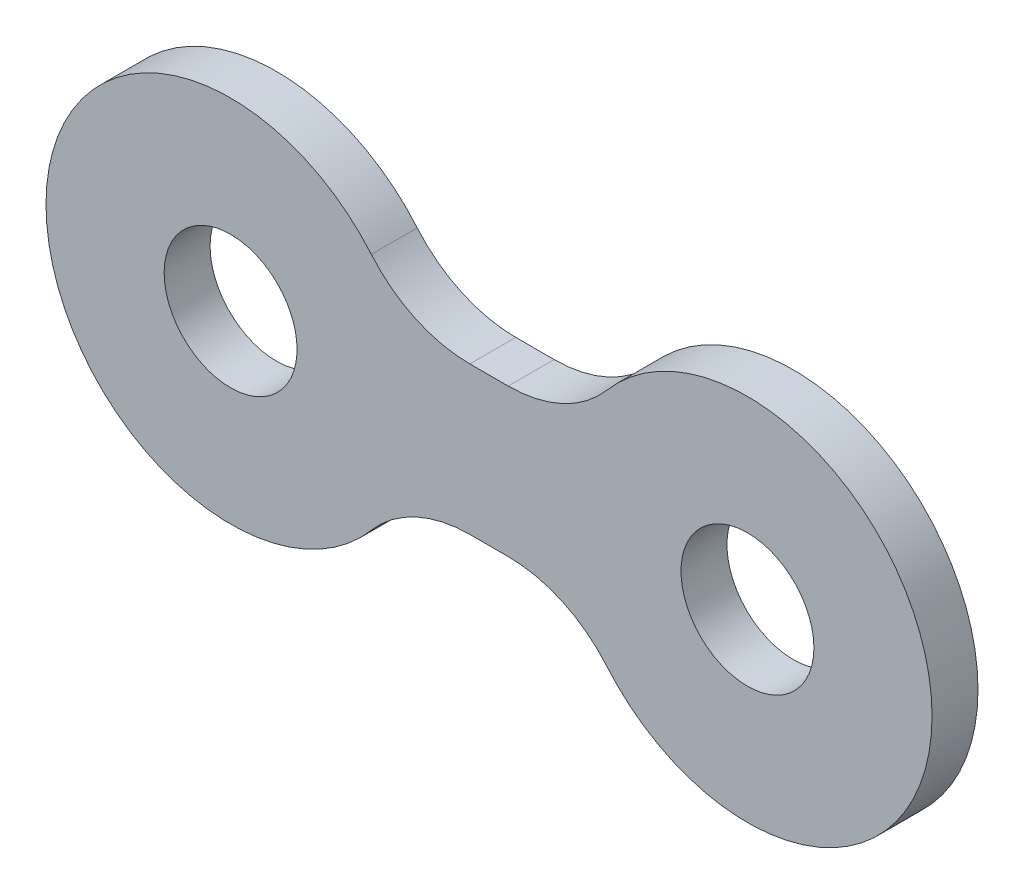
from build123d import *

# Parameters (mm, degrees)
SKETCH1_R           = 1.8
BOSS_EXTRUDE1_DEPTH = 1.2446
FILLET1_R           = 3.5


with BuildPart() as part:
    # Sketch1 → Boss-Extrude1 (new body)
    with BuildSketch(Plane.XY):
        with BuildLine():
            Line((-2.417424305, 2), (2.417424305, 2))
            ThreePointArc((2.417424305, 2), (12, 0), (2.417424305, -2))
            Line((2.417424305, -2), (-2.417424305, -2))
            ThreePointArc((-2.417424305, -2), (-12, 0), (-2.417424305, 2))
        make_face()
        with Locations((7, 0)):
            Circle(SKETCH1_R, mode=Mode.SUBTRACT)
        with Locations(Location((-7, 0, 0), (0, 0, 180))):
            Circle(SKETCH1_R, mode=Mode.SUBTRACT)
    extrude(amount=BOSS_EXTRUDE1_DEPTH)

    # Fillet1
    fillet1_edges = [part.edges().sort_by_distance(p)[0] for p in [
        (-2.417424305, 2, 0.6223),
        (2.417424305, 2, 0.6223),
        (2.417424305, -2, 0.6223),
        (-2.417424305, -2, 0.6223),
    ]]
    fillet(fillet1_edges, radius=FILLET1_R)


solid = part.part
